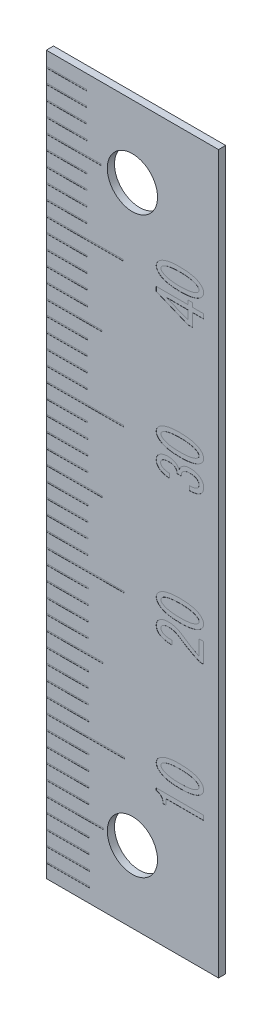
from build123d import *

# Parameters (mm, degrees)
SKETCH1_W      = 12
SKETCH1_H      = 50
EXTRUDE1_DEPTH = 0.5
SKETCH2_R      = 1.75
EXTRUDE2_DEPTH = 52.42227144
EXTRUDE3_DEPTH = 0.01
EXTRUDE4_DEPTH = 0.01


with BuildPart() as part:
    # Sketch1 → Extrude1 (new body)
    with BuildSketch(Plane.XY):
        with Locations((6, 25)):
            Rectangle(SKETCH1_W, SKETCH1_H)
    extrude(amount=EXTRUDE1_DEPTH)

    # Sketch2 → Extrude2 (cut, through all)
    with BuildSketch(Plane.XY.offset(0.5)):
        with Locations((6, 5)):
            Circle(SKETCH2_R)
        with Locations((6, 45)):
            Circle(SKETCH2_R)
    extrude(amount=-EXTRUDE2_DEPTH, mode=Mode.SUBTRACT)

    # Sketch3 → Extrude3 (cut)
    # profile 1 of 8: a face of its own
    with BuildSketch(Plane.XY.offset(0.5)):
        Polygon((10.964202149, 39.253595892), (10.576078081, 39.253595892), (10.18481385, 39.253595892), (10.18481385, 38.358021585), (9.863889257, 38.358021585), (7.659495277, 39.263016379), (7.659495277, 39.57326442), (9.863889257, 39.57326442), (9.863889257, 39.857135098), (10.18481385, 39.857135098), (10.18481385, 39.57326442), (10.964202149, 39.57326442), align=None)
        Polygon((9.863889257, 39.253595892), (8.371684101, 39.253595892), (9.863889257, 38.655080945), align=None, mode=Mode.SUBTRACT)
    # profile 2 of 8: a face of its own
    with BuildSketch(Plane.XY.offset(0.5)):
        with BuildLine():
            add(Edge.make_bspline(
                [(9.304312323, 40.08636695), (9.263487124, 40.086598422), (9.183284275, 40.087053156), (9.065184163, 40.090916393), (8.951677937, 40.097059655), (8.842790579, 40.105920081), (8.738418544, 40.116877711), (8.638826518, 40.131643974), (8.543659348, 40.147711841), (8.453367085, 40.166540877), (8.367534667, 40.187646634), (8.286660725, 40.212475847), (8.209981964, 40.238496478), (8.13792646, 40.267351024), (8.071052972, 40.299483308), (8.008231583, 40.333293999), (7.950513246, 40.370357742), (7.914537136, 40.397244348), (7.896891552, 40.410431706)],
                knots=[0, 0, 0, 0, 1.334199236, 2.621091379, 3.861325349, 5.048806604, 6.191184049, 7.29033474, 8.338632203, 9.344988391, 10.304094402, 11.226124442, 12.10888774, 12.949942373, 13.760906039, 14.53244093, 15.280190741, 16, 16, 16, 16], degree=3))
            add(Edge.make_bspline(
                [(7.896891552, 40.410431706), (7.877886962, 40.425936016), (7.841081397, 40.455962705), (7.793642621, 40.506288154), (7.75209867, 40.556343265), (7.718531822, 40.608467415), (7.691781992, 40.661574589), (7.673561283, 40.716630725), (7.661657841, 40.77250316), (7.660214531, 40.810429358), (7.659495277, 40.829329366)],
                knots=[0, 0, 0, 0, 1.179273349, 2.283859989, 3.322502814, 4.306324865, 5.261663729, 6.17616916, 7.091118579, 8, 8, 8, 8], degree=3))
            add(Edge.make_bspline(
                [(7.659495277, 40.829329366), (7.660212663, 40.848230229), (7.661652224, 40.886158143), (7.67358392, 40.942017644), (7.691636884, 40.996945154), (7.718688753, 41.049705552), (7.752296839, 41.101723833), (7.793217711, 41.152330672), (7.841340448, 41.202029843), (7.877935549, 41.232049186), (7.896891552, 41.247598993)],
                knots=[0, 0, 0, 0, 0.909839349, 1.825753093, 2.741222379, 3.688535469, 4.673394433, 5.720979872, 6.819483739, 8, 8, 8, 8], degree=3))
            add(Edge.make_bspline(
                [(7.896891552, 41.247598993), (7.914537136, 41.260786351), (7.950513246, 41.287672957), (8.008231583, 41.3247367), (8.071052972, 41.358547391), (8.13792646, 41.390679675), (8.209981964, 41.419534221), (8.286660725, 41.445554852), (8.367534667, 41.470384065), (8.453367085, 41.491489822), (8.543659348, 41.510318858), (8.638826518, 41.526386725), (8.738418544, 41.541152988), (8.842790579, 41.552110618), (8.951677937, 41.560971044), (9.065184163, 41.567114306), (9.183284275, 41.570977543), (9.263487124, 41.571432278), (9.304312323, 41.571663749)],
                knots=[0, 0, 0, 0, 0.719809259, 1.46755907, 2.239093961, 3.050057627, 3.89111226, 4.773875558, 5.695905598, 6.655011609, 7.661367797, 8.70966526, 9.808815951, 10.951193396, 12.138674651, 13.378908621, 14.665800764, 16, 16, 16, 16], degree=3))
            add(Edge.make_bspline(
                [(9.304312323, 41.571663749), (9.345974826, 41.571432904), (9.427642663, 41.570980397), (9.547627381, 41.567132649), (9.662805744, 41.560946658), (9.773365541, 41.552091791), (9.879218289, 41.541255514), (9.980042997, 41.52631378), (10.076267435, 41.510328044), (10.167806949, 41.49146689), (10.25471717, 41.470480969), (10.336402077, 41.445542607), (10.413707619, 41.419531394), (10.486394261, 41.390685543), (10.553875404, 41.358519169), (10.617234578, 41.324907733), (10.675058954, 41.28765614), (10.711041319, 41.260780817), (10.728689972, 41.247598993)],
                knots=[0, 0, 0, 0, 1.346341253, 2.639130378, 3.8790076, 5.073442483, 6.223226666, 7.316783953, 8.366697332, 9.375051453, 10.336565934, 11.254764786, 12.134057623, 12.971986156, 13.779994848, 14.548849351, 15.288238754, 16, 16, 16, 16], degree=3))
            add(Edge.make_bspline(
                [(10.728689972, 41.247598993), (10.747351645, 41.231964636), (10.783604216, 41.201592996), (10.832476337, 41.152791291), (10.872490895, 41.101447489), (10.906527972, 41.049937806), (10.932289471, 40.996615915), (10.951811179, 40.942259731), (10.962410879, 40.886054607), (10.964024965, 40.848209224), (10.964830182, 40.829329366)],
                knots=[0, 0, 0, 0, 1.1743338, 2.28128622, 3.323893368, 4.309986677, 5.254013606, 6.173907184, 7.08902033, 8, 8, 8, 8], degree=3))
            add(Edge.make_bspline(
                [(10.964830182, 40.829329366), (10.964023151, 40.81045032), (10.962405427, 40.772606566), (10.95183315, 40.716389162), (10.932141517, 40.661902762), (10.906685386, 40.608236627), (10.872691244, 40.556620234), (10.832051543, 40.505827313), (10.783860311, 40.456400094), (10.747399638, 40.426020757), (10.728689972, 40.410431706)],
                knots=[0, 0, 0, 0, 0.910025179, 1.824179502, 2.743109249, 3.69522398, 4.680284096, 5.713901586, 6.826896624, 8, 8, 8, 8], degree=3))
            add(Edge.make_bspline(
                [(10.728689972, 40.410431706), (10.711041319, 40.397249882), (10.675058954, 40.370374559), (10.617234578, 40.333122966), (10.553875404, 40.29951153), (10.486394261, 40.267345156), (10.413707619, 40.238499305), (10.336402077, 40.212488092), (10.25471717, 40.18754973), (10.167806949, 40.166563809), (10.076267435, 40.147702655), (9.980042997, 40.131716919), (9.879218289, 40.116775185), (9.773365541, 40.105938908), (9.662805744, 40.097084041), (9.547627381, 40.09089805), (9.427642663, 40.087050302), (9.345974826, 40.086597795), (9.304312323, 40.08636695)],
                knots=[0, 0, 0, 0, 0.711761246, 1.451150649, 2.220005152, 3.028013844, 3.865942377, 4.745235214, 5.663434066, 6.624948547, 7.633302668, 8.683216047, 9.776773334, 10.926557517, 12.1209924, 13.360869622, 14.653658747, 16, 16, 16, 16], degree=3))
        make_face()
        with BuildLine():
            add(Edge.make_bspline(
                [(9.304312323, 41.261415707), (9.267676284, 41.261069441), (9.195861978, 41.260390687), (9.090316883, 41.258165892), (8.989150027, 41.253278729), (8.892481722, 41.245290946), (8.80022693, 41.237179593), (8.712814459, 41.225295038), (8.629718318, 41.213328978), (8.551258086, 41.197943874), (8.47692929, 41.181420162), (8.407398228, 41.16150603), (8.341873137, 41.141413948), (8.281453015, 41.117852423), (8.225379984, 41.092883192), (8.173815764, 41.065786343), (8.126168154, 41.037204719), (8.097468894, 41.015283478), (8.083417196, 41.004550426)],
                knots=[0, 0, 0, 0, 1.387476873, 2.71974516, 3.997715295, 5.222316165, 6.392993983, 7.5041764, 8.562605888, 9.571696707, 10.531368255, 11.445041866, 12.310057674, 13.125709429, 13.899281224, 14.633331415, 15.330853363, 16, 16, 16, 16], degree=3))
            add(Edge.make_bspline(
                [(8.083417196, 41.004550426), (8.067942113, 40.991309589), (8.038992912, 40.966539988), (8.006840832, 40.922559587), (7.985224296, 40.87705391), (7.982844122, 40.845041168), (7.981675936, 40.829329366)],
                knots=[0, 0, 0, 0, 1.162721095, 2.175099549, 3.10434177, 4, 4, 4, 4], degree=3))
            add(Edge.make_bspline(
                [(7.981675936, 40.829329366), (7.982836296, 40.813611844), (7.985200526, 40.781587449), (8.007018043, 40.736019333), (8.038753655, 40.691521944), (8.067903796, 40.666693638), (8.083417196, 40.653480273)],
                knots=[0, 0, 0, 0, 0.893494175, 1.820491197, 2.840088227, 4, 4, 4, 4], degree=3))
            add(Edge.make_bspline(
                [(8.083417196, 40.653480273), (8.098156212, 40.643035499), (8.128454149, 40.621564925), (8.177291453, 40.592299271), (8.230299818, 40.565060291), (8.287887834, 40.540907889), (8.349363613, 40.517529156), (8.415145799, 40.496237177), (8.485227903, 40.477516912), (8.559390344, 40.460570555), (8.637959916, 40.445608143), (8.720652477, 40.432335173), (8.807623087, 40.421817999), (8.898748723, 40.413272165), (8.994176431, 40.405404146), (9.093874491, 40.400498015), (9.197746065, 40.398267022), (9.268304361, 40.397589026), (9.304312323, 40.397243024)],
                knots=[0, 0, 0, 0, 0.684573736, 1.407229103, 2.156074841, 2.941731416, 3.772993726, 4.648817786, 5.561264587, 6.521855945, 7.531913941, 8.592575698, 9.69595549, 10.851956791, 12.06190895, 13.325252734, 14.634998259, 16, 16, 16, 16], degree=3))
            add(Edge.make_bspline(
                [(9.304312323, 40.397243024), (9.341785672, 40.397588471), (9.415065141, 40.398263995), (9.522703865, 40.400490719), (9.625541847, 40.405385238), (9.723691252, 40.413273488), (9.817323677, 40.421841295), (9.906404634, 40.432229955), (9.990753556, 40.445635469), (10.070391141, 40.460491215), (10.145369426, 40.477539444), (10.215901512, 40.496147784), (10.281702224, 40.517419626), (10.342729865, 40.540898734), (10.399661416, 40.565104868), (10.451853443, 40.591966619), (10.49904188, 40.621590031), (10.528053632, 40.643045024), (10.542164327, 40.653480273)],
                knots=[0, 0, 0, 0, 1.401046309, 2.739758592, 4.0248449, 5.249399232, 6.420696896, 7.540008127, 8.601571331, 9.613140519, 10.568176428, 11.475655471, 12.339456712, 13.151990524, 13.919674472, 14.651282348, 15.344012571, 16, 16, 16, 16], degree=3))
            add(Edge.make_bspline(
                [(10.542164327, 40.653480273), (10.557596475, 40.666746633), (10.586687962, 40.691755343), (10.619429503, 40.735654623), (10.640196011, 40.781762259), (10.642682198, 40.813642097), (10.643905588, 40.829329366)],
                knots=[0, 0, 0, 0, 1.159232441, 2.18529495, 3.107029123, 4, 4, 4, 4], degree=3))
            add(Edge.make_bspline(
                [(10.643905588, 40.829329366), (10.642674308, 40.845010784), (10.640172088, 40.876878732), (10.619603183, 40.922925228), (10.586449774, 40.966304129), (10.557558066, 40.991255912), (10.542164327, 41.004550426)],
                knots=[0, 0, 0, 0, 0.89511734, 1.819067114, 2.837981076, 4, 4, 4, 4], degree=3))
            add(Edge.make_bspline(
                [(10.542164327, 41.004550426), (10.528109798, 41.015278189), (10.499404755, 41.037188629), (10.45164342, 41.065951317), (10.399548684, 41.092855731), (10.342868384, 41.117856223), (10.281814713, 41.14140776), (10.215668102, 41.161504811), (10.14550559, 41.181409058), (10.070358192, 41.198018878), (9.990830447, 41.213306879), (9.906283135, 41.225349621), (9.817389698, 41.237124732), (9.72367965, 41.245296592), (9.625545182, 41.253298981), (9.522702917, 41.258160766), (9.415065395, 41.26039668), (9.341785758, 41.261070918), (9.304312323, 41.261415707)],
                knots=[0, 0, 0, 0, 0.660466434, 1.348940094, 2.080407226, 2.851088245, 3.663465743, 4.524722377, 5.434082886, 6.388935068, 7.400309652, 8.46048529, 9.580538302, 10.751610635, 11.975929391, 13.260768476, 14.599223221, 16, 16, 16, 16], degree=3))
        make_face(mode=Mode.SUBTRACT)
    # profile 3 of 8: a face of its own
    with BuildSketch(Plane.XY.offset(0.5)):
        with BuildLine():
            add(Edge.make_bspline(
                [(9.982587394, 28.709091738), (10.012525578, 28.708287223), (10.070543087, 28.706728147), (10.154420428, 28.710760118), (10.232130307, 28.718455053), (10.303298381, 28.73168567), (10.368273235, 28.749141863), (10.427053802, 28.770782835), (10.479378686, 28.79791141), (10.510164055, 28.820091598), (10.525207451, 28.830930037)],
                knots=[0, 0, 0, 0, 1.267087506, 2.455501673, 3.55133733, 4.569646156, 5.515332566, 6.395721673, 7.21606285, 8, 8, 8, 8], degree=3))
            add(Edge.make_bspline(
                [(10.525207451, 28.830930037), (10.543506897, 28.847280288), (10.579345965, 28.8793019), (10.617183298, 28.941459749), (10.639871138, 29.011713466), (10.642530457, 29.061449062), (10.643905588, 29.087167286)],
                knots=[0, 0, 0, 0, 1.002413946, 1.963205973, 2.946775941, 4, 4, 4, 4], degree=3))
            add(Edge.make_bspline(
                [(10.643905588, 29.087167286), (10.64205895, 29.10966892), (10.638250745, 29.15607263), (10.60631016, 29.222801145), (10.557507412, 29.287350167), (10.514319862, 29.324320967), (10.491293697, 29.344032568)],
                knots=[0, 0, 0, 0, 0.87119639, 1.796613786, 2.82522778, 4, 4, 4, 4], degree=3))
            add(Edge.make_bspline(
                [(10.491293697, 29.344032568), (10.477715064, 29.35383947), (10.449615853, 29.374133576), (10.40102721, 29.398039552), (10.347048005, 29.41973801), (10.286272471, 29.436247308), (10.219328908, 29.449449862), (10.146079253, 29.458528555), (10.066417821, 29.464292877), (10.011278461, 29.464917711), (9.982587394, 29.465242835)],
                knots=[0, 0, 0, 0, 0.754595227, 1.561536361, 2.43511806, 3.377163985, 4.397951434, 5.512234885, 6.705522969, 8, 8, 8, 8], degree=3))
            add(Edge.make_bspline(
                [(9.982587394, 29.465242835), (9.960377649, 29.46473344), (9.916687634, 29.463731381), (9.85267071, 29.456647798), (9.791236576, 29.44559945), (9.732735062, 29.428991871), (9.676430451, 29.40846888), (9.623062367, 29.382368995), (9.571883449, 29.352579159), (9.540443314, 29.328863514), (9.524751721, 29.317027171)],
                knots=[0, 0, 0, 0, 1.086352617, 2.137024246, 3.147391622, 4.136355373, 5.10847195, 6.074961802, 7.039224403, 8, 8, 8, 8], degree=3))
            add(Edge.make_bspline(
                [(9.524751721, 29.317027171), (9.514022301, 29.307663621), (9.492758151, 29.289106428), (9.465670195, 29.256771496), (9.44319759, 29.221167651), (9.426529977, 29.181802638), (9.413593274, 29.139332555), (9.406578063, 29.093273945), (9.403067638, 29.044064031), (9.405038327, 29.010337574), (9.406053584, 28.992962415)],
                knots=[0, 0, 0, 0, 0.947861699, 1.87852391, 2.799832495, 3.743268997, 4.71875736, 5.750864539, 6.841292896, 8, 8, 8, 8], degree=3))
            Line((9.406053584, 28.992962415), (9.117786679, 28.992962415))
            add(Edge.make_bspline(
                [(9.117786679, 28.992962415), (9.115917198, 29.01036469), (9.11227151, 29.044300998), (9.103170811, 29.09366086), (9.089082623, 29.139312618), (9.072365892, 29.182135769), (9.050836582, 29.220887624), (9.026138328, 29.256550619), (8.997813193, 29.288974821), (8.976089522, 29.307646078), (8.965174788, 29.317027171)],
                knots=[0, 0, 0, 0, 1.139052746, 2.221275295, 3.260086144, 4.244297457, 5.207730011, 6.137529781, 7.064229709, 8, 8, 8, 8], degree=3))
            add(Edge.make_bspline(
                [(8.965174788, 29.317027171), (8.953430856, 29.325692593), (8.929384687, 29.343435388), (8.888683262, 29.365118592), (8.844024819, 29.38418922), (8.794826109, 29.398815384), (8.741812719, 29.411043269), (8.684417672, 29.41879032), (8.62278159, 29.423939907), (8.580202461, 29.42467109), (8.558209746, 29.425048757)],
                knots=[0, 0, 0, 0, 0.816014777, 1.670822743, 2.574059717, 3.530392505, 4.539613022, 5.616822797, 6.769055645, 8, 8, 8, 8], degree=3))
            add(Edge.make_bspline(
                [(8.558209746, 29.425048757), (8.530985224, 29.424710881), (8.478357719, 29.424057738), (8.402231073, 29.418395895), (8.331762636, 29.409047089), (8.266898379, 29.396390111), (8.208285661, 29.3784051), (8.154956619, 29.358063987), (8.10766056, 29.33316966), (8.079858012, 29.312952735), (8.06646032, 29.303210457)],
                knots=[0, 0, 0, 0, 1.267211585, 2.44963652, 3.550842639, 4.575246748, 5.5217347, 6.401234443, 7.229575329, 8, 8, 8, 8], degree=3))
            add(Edge.make_bspline(
                [(8.06646032, 29.303210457), (8.050800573, 29.289680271), (8.020516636, 29.263514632), (7.989112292, 29.21338768), (7.967772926, 29.159180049), (7.965751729, 29.120663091), (7.964719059, 29.100984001)],
                knots=[0, 0, 0, 0, 1.053722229, 2.037763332, 2.997453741, 4, 4, 4, 4], degree=3))
            add(Edge.make_bspline(
                [(7.964719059, 29.100984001), (7.965793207, 29.081323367), (7.967906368, 29.0426452), (7.988749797, 28.988170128), (8.020925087, 28.938367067), (8.050860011, 28.911914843), (8.06646032, 28.898129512)],
                knots=[0, 0, 0, 0, 1.000412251, 1.968100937, 2.94109465, 4, 4, 4, 4], degree=3))
            add(Edge.make_bspline(
                [(8.06646032, 28.898129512), (8.081277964, 28.887055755), (8.111428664, 28.864523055), (8.162612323, 28.837488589), (8.218046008, 28.812216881), (8.279698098, 28.793150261), (8.345928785, 28.775455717), (8.417710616, 28.763754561), (8.494531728, 28.75366975), (8.547707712, 28.75119286), (8.575166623, 28.749913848)],
                knots=[0, 0, 0, 0, 0.823448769, 1.675540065, 2.573857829, 3.535986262, 4.547798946, 5.627975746, 6.775138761, 8, 8, 8, 8], degree=3))
            Line((8.575166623, 28.749913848), (8.575166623, 28.452854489))
            add(Edge.make_bspline(
                [(8.575166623, 28.452854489), (8.539320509, 28.454383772), (8.469081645, 28.457380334), (8.36662153, 28.471341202), (8.269148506, 28.489228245), (8.177509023, 28.515831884), (8.090488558, 28.54647123), (8.009243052, 28.585395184), (7.932662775, 28.629471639), (7.886090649, 28.664635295), (7.862977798, 28.682086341)],
                knots=[0, 0, 0, 0, 1.130465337, 2.215096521, 3.257023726, 4.251490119, 5.220175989, 6.161913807, 7.087793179, 8, 8, 8, 8], degree=3))
            add(Edge.make_bspline(
                [(7.862977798, 28.682086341), (7.8467956, 28.695809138), (7.81513049, 28.722661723), (7.772968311, 28.767477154), (7.738724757, 28.816404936), (7.709237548, 28.867139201), (7.68725208, 28.92158891), (7.670766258, 28.978543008), (7.661240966, 29.038909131), (7.660084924, 29.080016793), (7.659495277, 29.100984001)],
                knots=[0, 0, 0, 0, 1.054146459, 2.062739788, 3.04727221, 4.0164563, 4.972878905, 5.957576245, 6.958249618, 8, 8, 8, 8], degree=3))
            add(Edge.make_bspline(
                [(7.659495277, 29.100984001), (7.660084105, 29.122995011), (7.661233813, 29.165972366), (7.67065538, 29.228867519), (7.687412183, 29.288028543), (7.708926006, 29.344536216), (7.738532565, 29.396768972), (7.773183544, 29.446397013), (7.814699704, 29.492477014), (7.846729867, 29.519408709), (7.862977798, 29.533070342)],
                knots=[0, 0, 0, 0, 1.066551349, 2.082482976, 3.072030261, 4.042353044, 5.005167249, 5.973525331, 6.972030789, 8, 8, 8, 8], degree=3))
            add(Edge.make_bspline(
                [(7.862977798, 29.533070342), (7.883180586, 29.548391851), (7.923800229, 29.579197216), (7.99101211, 29.617407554), (8.063031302, 29.649133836), (8.139054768, 29.676462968), (8.220201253, 29.697274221), (8.306188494, 29.711237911), (8.396823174, 29.720285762), (8.458748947, 29.721491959), (8.490382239, 29.722108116)],
                knots=[0, 0, 0, 0, 0.910342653, 1.830331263, 2.769796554, 3.735781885, 4.730142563, 5.775142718, 6.863485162, 8, 8, 8, 8], degree=3))
            add(Edge.make_bspline(
                [(8.490382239, 29.722108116), (8.519286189, 29.72161156), (8.575295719, 29.720649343), (8.656472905, 29.713669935), (8.732474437, 29.70249683), (8.803229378, 29.686672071), (8.868446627, 29.664650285), (8.928974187, 29.640082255), (8.984286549, 29.610093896), (9.016949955, 29.585400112), (9.033002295, 29.57326442)],
                knots=[0, 0, 0, 0, 1.210143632, 2.344993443, 3.40861805, 4.424997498, 5.37575867, 6.287368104, 7.158331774, 8, 8, 8, 8], degree=3))
            add(Edge.make_bspline(
                [(9.033002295, 29.57326442), (9.059175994, 29.551536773), (9.108490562, 29.51059913), (9.171793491, 29.445781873), (9.221317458, 29.38266922), (9.243208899, 29.337936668), (9.253441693, 29.317027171)],
                knots=[0, 0, 0, 0, 1.195517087, 2.252505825, 3.183162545, 4, 4, 4, 4], degree=3))
            add(Edge.make_bspline(
                [(9.253441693, 29.317027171), (9.265088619, 29.34500906), (9.287538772, 29.398945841), (9.331763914, 29.47199791), (9.381380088, 29.535717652), (9.420772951, 29.570253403), (9.439967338, 29.587081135)],
                knots=[0, 0, 0, 0, 1.094399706, 2.109521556, 3.078854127, 4, 4, 4, 4], degree=3))
            add(Edge.make_bspline(
                [(9.439967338, 29.587081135), (9.459994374, 29.60234586), (9.499821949, 29.632702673), (9.564355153, 29.670989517), (9.632227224, 29.703077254), (9.702874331, 29.730156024), (9.776856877, 29.751027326), (9.854027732, 29.765256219), (9.934226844, 29.774233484), (9.988843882, 29.775485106), (10.016501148, 29.776118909)],
                knots=[0, 0, 0, 0, 0.976244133, 1.941447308, 2.904084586, 3.885987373, 4.873249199, 5.881498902, 6.927222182, 8, 8, 8, 8], degree=3))
            add(Edge.make_bspline(
                [(10.016501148, 29.776118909), (10.052324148, 29.77559206), (10.122443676, 29.774560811), (10.225084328, 29.764261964), (10.322576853, 29.747624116), (10.414506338, 29.72361205), (10.501245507, 29.69357359), (10.582537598, 29.656250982), (10.659144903, 29.612707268), (10.705595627, 29.577553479), (10.728689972, 29.560075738)],
                knots=[0, 0, 0, 0, 1.13285732, 2.217441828, 3.259318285, 4.258350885, 5.219645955, 6.158999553, 7.084692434, 8, 8, 8, 8], degree=3))
            add(Edge.make_bspline(
                [(10.728689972, 29.560075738), (10.747408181, 29.544073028), (10.784031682, 29.512762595), (10.832853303, 29.461250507), (10.873280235, 29.40591535), (10.906871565, 29.348128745), (10.932721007, 29.287091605), (10.951971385, 29.223397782), (10.962541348, 29.156184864), (10.964058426, 29.110438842), (10.964830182, 29.087167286)],
                knots=[0, 0, 0, 0, 1.078182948, 2.109541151, 3.099814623, 4.073306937, 5.030426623, 5.996463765, 6.980776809, 8, 8, 8, 8], degree=3))
            add(Edge.make_bspline(
                [(10.964830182, 29.087167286), (10.964367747, 29.062001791), (10.963461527, 29.012685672), (10.952274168, 28.941195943), (10.935512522, 28.873719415), (10.911441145, 28.810497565), (10.88066456, 28.751121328), (10.842591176, 28.696168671), (10.797876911, 28.645289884), (10.763207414, 28.615937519), (10.745646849, 28.601070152)],
                knots=[0, 0, 0, 0, 1.091653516, 2.139282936, 3.133504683, 4.105839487, 5.069340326, 6.029921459, 7.002128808, 8, 8, 8, 8], degree=3))
            add(Edge.make_bspline(
                [(10.745646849, 28.601070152), (10.723356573, 28.584883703), (10.677849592, 28.551838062), (10.601818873, 28.510403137), (10.51783525, 28.476087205), (10.426096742, 28.448030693), (10.326687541, 28.425207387), (10.21890008, 28.410072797), (10.103344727, 28.400491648), (10.023639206, 28.399403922), (9.982587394, 28.398843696)],
                knots=[0, 0, 0, 0, 0.821972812, 1.678108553, 2.577822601, 3.526913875, 4.539938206, 5.620279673, 6.774340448, 8, 8, 8, 8], degree=3))
            Line((9.982587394, 28.398843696), (9.982587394, 28.709091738))
        make_face()
    # profile 4 of 8: a face of its own
    with BuildSketch(Plane.XY.offset(0.5)):
        with BuildLine():
            add(Edge.make_bspline(
                [(9.304312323, 30.08636695), (9.263487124, 30.086598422), (9.183284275, 30.087053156), (9.065184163, 30.090916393), (8.951677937, 30.097059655), (8.842790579, 30.105920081), (8.738418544, 30.116877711), (8.638826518, 30.131643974), (8.543659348, 30.147711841), (8.453367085, 30.166540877), (8.367534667, 30.187646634), (8.286660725, 30.212475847), (8.209981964, 30.238496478), (8.13792646, 30.267351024), (8.071052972, 30.299483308), (8.008231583, 30.333293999), (7.950513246, 30.370357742), (7.914537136, 30.397244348), (7.896891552, 30.410431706)],
                knots=[0, 0, 0, 0, 1.334199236, 2.621091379, 3.861325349, 5.048806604, 6.191184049, 7.29033474, 8.338632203, 9.344988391, 10.304094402, 11.226124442, 12.10888774, 12.949942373, 13.760906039, 14.53244093, 15.280190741, 16, 16, 16, 16], degree=3))
            add(Edge.make_bspline(
                [(7.896891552, 30.410431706), (7.877886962, 30.425936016), (7.841081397, 30.455962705), (7.793642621, 30.506288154), (7.75209867, 30.556343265), (7.718531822, 30.608467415), (7.691781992, 30.661574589), (7.673561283, 30.716630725), (7.661657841, 30.77250316), (7.660214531, 30.810429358), (7.659495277, 30.829329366)],
                knots=[0, 0, 0, 0, 1.179273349, 2.283859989, 3.322502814, 4.306324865, 5.261663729, 6.17616916, 7.091118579, 8, 8, 8, 8], degree=3))
            add(Edge.make_bspline(
                [(7.659495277, 30.829329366), (7.660212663, 30.848230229), (7.661652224, 30.886158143), (7.67358392, 30.942017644), (7.691636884, 30.996945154), (7.718688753, 31.049705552), (7.752296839, 31.101723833), (7.793217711, 31.152330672), (7.841340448, 31.202029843), (7.877935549, 31.232049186), (7.896891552, 31.247598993)],
                knots=[0, 0, 0, 0, 0.909839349, 1.825753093, 2.741222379, 3.688535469, 4.673394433, 5.720979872, 6.819483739, 8, 8, 8, 8], degree=3))
            add(Edge.make_bspline(
                [(7.896891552, 31.247598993), (7.914537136, 31.260786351), (7.950513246, 31.287672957), (8.008231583, 31.3247367), (8.071052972, 31.358547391), (8.13792646, 31.390679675), (8.209981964, 31.419534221), (8.286660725, 31.445554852), (8.367534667, 31.470384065), (8.453367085, 31.491489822), (8.543659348, 31.510318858), (8.638826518, 31.526386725), (8.738418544, 31.541152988), (8.842790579, 31.552110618), (8.951677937, 31.560971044), (9.065184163, 31.567114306), (9.183284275, 31.570977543), (9.263487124, 31.571432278), (9.304312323, 31.571663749)],
                knots=[0, 0, 0, 0, 0.719809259, 1.46755907, 2.239093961, 3.050057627, 3.89111226, 4.773875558, 5.695905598, 6.655011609, 7.661367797, 8.70966526, 9.808815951, 10.951193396, 12.138674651, 13.378908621, 14.665800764, 16, 16, 16, 16], degree=3))
            add(Edge.make_bspline(
                [(9.304312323, 31.571663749), (9.345974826, 31.571432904), (9.427642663, 31.570980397), (9.547627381, 31.567132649), (9.662805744, 31.560946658), (9.773365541, 31.552091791), (9.879218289, 31.541255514), (9.980042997, 31.52631378), (10.076267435, 31.510328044), (10.167806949, 31.49146689), (10.25471717, 31.470480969), (10.336402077, 31.445542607), (10.413707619, 31.419531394), (10.486394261, 31.390685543), (10.553875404, 31.358519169), (10.617234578, 31.324907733), (10.675058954, 31.28765614), (10.711041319, 31.260780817), (10.728689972, 31.247598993)],
                knots=[0, 0, 0, 0, 1.346341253, 2.639130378, 3.8790076, 5.073442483, 6.223226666, 7.316783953, 8.366697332, 9.375051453, 10.336565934, 11.254764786, 12.134057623, 12.971986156, 13.779994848, 14.548849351, 15.288238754, 16, 16, 16, 16], degree=3))
            add(Edge.make_bspline(
                [(10.728689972, 31.247598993), (10.747351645, 31.231964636), (10.783604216, 31.201592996), (10.832476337, 31.152791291), (10.872490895, 31.101447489), (10.906527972, 31.049937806), (10.932289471, 30.996615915), (10.951811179, 30.942259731), (10.962410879, 30.886054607), (10.964024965, 30.848209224), (10.964830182, 30.829329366)],
                knots=[0, 0, 0, 0, 1.1743338, 2.28128622, 3.323893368, 4.309986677, 5.254013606, 6.173907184, 7.08902033, 8, 8, 8, 8], degree=3))
            add(Edge.make_bspline(
                [(10.964830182, 30.829329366), (10.964023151, 30.81045032), (10.962405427, 30.772606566), (10.95183315, 30.716389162), (10.932141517, 30.661902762), (10.906685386, 30.608236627), (10.872691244, 30.556620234), (10.832051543, 30.505827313), (10.783860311, 30.456400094), (10.747399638, 30.426020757), (10.728689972, 30.410431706)],
                knots=[0, 0, 0, 0, 0.910025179, 1.824179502, 2.743109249, 3.69522398, 4.680284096, 5.713901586, 6.826896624, 8, 8, 8, 8], degree=3))
            add(Edge.make_bspline(
                [(10.728689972, 30.410431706), (10.711041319, 30.397249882), (10.675058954, 30.370374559), (10.617234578, 30.333122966), (10.553875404, 30.29951153), (10.486394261, 30.267345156), (10.413707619, 30.238499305), (10.336402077, 30.212488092), (10.25471717, 30.18754973), (10.167806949, 30.166563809), (10.076267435, 30.147702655), (9.980042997, 30.131716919), (9.879218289, 30.116775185), (9.773365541, 30.105938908), (9.662805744, 30.097084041), (9.547627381, 30.09089805), (9.427642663, 30.087050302), (9.345974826, 30.086597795), (9.304312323, 30.08636695)],
                knots=[0, 0, 0, 0, 0.711761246, 1.451150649, 2.220005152, 3.028013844, 3.865942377, 4.745235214, 5.663434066, 6.624948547, 7.633302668, 8.683216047, 9.776773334, 10.926557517, 12.1209924, 13.360869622, 14.653658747, 16, 16, 16, 16], degree=3))
        make_face()
        with BuildLine():
            add(Edge.make_bspline(
                [(9.304312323, 31.261415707), (9.267676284, 31.261069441), (9.195861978, 31.260390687), (9.090316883, 31.258165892), (8.989150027, 31.253278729), (8.892481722, 31.245290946), (8.80022693, 31.237179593), (8.712814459, 31.225295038), (8.629718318, 31.213328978), (8.551258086, 31.197943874), (8.47692929, 31.181420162), (8.407398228, 31.16150603), (8.341873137, 31.141413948), (8.281453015, 31.117852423), (8.225379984, 31.092883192), (8.173815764, 31.065786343), (8.126168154, 31.037204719), (8.097468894, 31.015283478), (8.083417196, 31.004550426)],
                knots=[0, 0, 0, 0, 1.387476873, 2.71974516, 3.997715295, 5.222316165, 6.392993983, 7.5041764, 8.562605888, 9.571696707, 10.531368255, 11.445041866, 12.310057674, 13.125709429, 13.899281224, 14.633331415, 15.330853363, 16, 16, 16, 16], degree=3))
            add(Edge.make_bspline(
                [(8.083417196, 31.004550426), (8.067942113, 30.991309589), (8.038992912, 30.966539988), (8.006840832, 30.922559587), (7.985224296, 30.87705391), (7.982844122, 30.845041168), (7.981675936, 30.829329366)],
                knots=[0, 0, 0, 0, 1.162721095, 2.175099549, 3.10434177, 4, 4, 4, 4], degree=3))
            add(Edge.make_bspline(
                [(7.981675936, 30.829329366), (7.982836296, 30.813611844), (7.985200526, 30.781587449), (8.007018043, 30.736019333), (8.038753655, 30.691521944), (8.067903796, 30.666693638), (8.083417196, 30.653480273)],
                knots=[0, 0, 0, 0, 0.893494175, 1.820491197, 2.840088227, 4, 4, 4, 4], degree=3))
            add(Edge.make_bspline(
                [(8.083417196, 30.653480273), (8.098156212, 30.643035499), (8.128454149, 30.621564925), (8.177291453, 30.592299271), (8.230299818, 30.565060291), (8.287887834, 30.540907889), (8.349363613, 30.517529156), (8.415145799, 30.496237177), (8.485227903, 30.477516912), (8.559390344, 30.460570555), (8.637959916, 30.445608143), (8.720652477, 30.432335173), (8.807623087, 30.421817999), (8.898748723, 30.413272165), (8.994176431, 30.405404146), (9.093874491, 30.400498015), (9.197746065, 30.398267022), (9.268304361, 30.397589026), (9.304312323, 30.397243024)],
                knots=[0, 0, 0, 0, 0.684573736, 1.407229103, 2.156074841, 2.941731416, 3.772993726, 4.648817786, 5.561264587, 6.521855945, 7.531913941, 8.592575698, 9.69595549, 10.851956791, 12.06190895, 13.325252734, 14.634998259, 16, 16, 16, 16], degree=3))
            add(Edge.make_bspline(
                [(9.304312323, 30.397243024), (9.341785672, 30.397588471), (9.415065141, 30.398263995), (9.522703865, 30.400490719), (9.625541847, 30.405385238), (9.723691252, 30.413273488), (9.817323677, 30.421841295), (9.906404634, 30.432229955), (9.990753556, 30.445635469), (10.070391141, 30.460491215), (10.145369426, 30.477539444), (10.215901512, 30.496147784), (10.281702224, 30.517419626), (10.342729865, 30.540898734), (10.399661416, 30.565104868), (10.451853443, 30.591966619), (10.49904188, 30.621590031), (10.528053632, 30.643045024), (10.542164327, 30.653480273)],
                knots=[0, 0, 0, 0, 1.401046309, 2.739758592, 4.0248449, 5.249399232, 6.420696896, 7.540008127, 8.601571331, 9.613140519, 10.568176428, 11.475655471, 12.339456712, 13.151990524, 13.919674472, 14.651282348, 15.344012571, 16, 16, 16, 16], degree=3))
            add(Edge.make_bspline(
                [(10.542164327, 30.653480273), (10.557596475, 30.666746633), (10.586687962, 30.691755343), (10.619429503, 30.735654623), (10.640196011, 30.781762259), (10.642682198, 30.813642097), (10.643905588, 30.829329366)],
                knots=[0, 0, 0, 0, 1.159232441, 2.18529495, 3.107029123, 4, 4, 4, 4], degree=3))
            add(Edge.make_bspline(
                [(10.643905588, 30.829329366), (10.642674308, 30.845010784), (10.640172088, 30.876878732), (10.619603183, 30.922925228), (10.586449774, 30.966304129), (10.557558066, 30.991255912), (10.542164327, 31.004550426)],
                knots=[0, 0, 0, 0, 0.89511734, 1.819067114, 2.837981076, 4, 4, 4, 4], degree=3))
            add(Edge.make_bspline(
                [(10.542164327, 31.004550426), (10.528109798, 31.015278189), (10.499404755, 31.037188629), (10.45164342, 31.065951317), (10.399548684, 31.092855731), (10.342868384, 31.117856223), (10.281814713, 31.14140776), (10.215668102, 31.161504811), (10.14550559, 31.181409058), (10.070358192, 31.198018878), (9.990830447, 31.213306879), (9.906283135, 31.225349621), (9.817389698, 31.237124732), (9.72367965, 31.245296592), (9.625545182, 31.253298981), (9.522702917, 31.258160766), (9.415065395, 31.26039668), (9.341785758, 31.261070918), (9.304312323, 31.261415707)],
                knots=[0, 0, 0, 0, 0.660466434, 1.348940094, 2.080407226, 2.851088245, 3.663465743, 4.524722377, 5.434082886, 6.388935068, 7.400309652, 8.46048529, 9.580538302, 10.751610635, 11.975929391, 13.260768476, 14.599223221, 16, 16, 16, 16], degree=3))
        make_face(mode=Mode.SUBTRACT)
    # profile 5 of 8: a face of its own
    with BuildSketch(Plane.XY.offset(0.5)):
        with BuildLine():
            Line((10.643905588, 19.789307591), (10.964830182, 19.789307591))
            Line((10.964830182, 19.789307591), (10.964830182, 18.412032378))
            Line((10.964830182, 18.412032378), (10.694776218, 18.412032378))
            add(Edge.make_bspline(
                [(10.694776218, 18.412032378), (10.634104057, 18.438239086), (10.512820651, 18.490626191), (10.333941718, 18.576059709), (10.15666089, 18.664824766), (9.982086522, 18.759401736), (9.809323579, 18.858008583), (9.638392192, 18.960822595), (9.469988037, 19.068963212), (9.359615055, 19.144268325), (9.304312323, 19.18200019)],
                knots=[0, 0, 0, 0, 0.99614483, 1.991289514, 2.987624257, 3.984438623, 4.983697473, 5.985971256, 6.990864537, 8, 8, 8, 8], degree=3))
            add(Edge.make_bspline(
                [(9.304312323, 19.18200019), (9.273407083, 19.202561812), (9.212458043, 19.24311193), (9.117211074, 19.295150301), (9.021104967, 19.339278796), (8.923672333, 19.375332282), (8.825440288, 19.4035815), (8.72593849, 19.42388529), (8.625513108, 19.436178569), (8.558034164, 19.437551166), (8.524295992, 19.438237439)],
                knots=[0, 0, 0, 0, 1.067918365, 2.106070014, 3.119789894, 4.109153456, 5.093164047, 6.058534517, 7.029304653, 8, 8, 8, 8], degree=3))
            add(Edge.make_bspline(
                [(8.524295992, 19.438237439), (8.501046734, 19.437894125), (8.455732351, 19.437224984), (8.389860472, 19.431518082), (8.328132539, 19.422267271), (8.270797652, 19.409104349), (8.21743613, 19.392320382), (8.168710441, 19.370724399), (8.123431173, 19.346637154), (8.096599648, 19.326782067), (8.083417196, 19.317027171)],
                knots=[0, 0, 0, 0, 1.197973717, 2.334932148, 3.404529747, 4.412096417, 5.3640046, 6.281988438, 7.155932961, 8, 8, 8, 8], degree=3))
            add(Edge.make_bspline(
                [(8.083417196, 19.317027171), (8.067746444, 19.303076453), (8.037248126, 19.275925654), (8.005254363, 19.223199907), (7.984772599, 19.164442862), (7.982726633, 19.122515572), (7.981675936, 19.100984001)],
                knots=[0, 0, 0, 0, 1.01321699, 1.971916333, 2.958486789, 4, 4, 4, 4], degree=3))
            add(Edge.make_bspline(
                [(7.981675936, 19.100984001), (7.983585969, 19.082717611), (7.987575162, 19.044567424), (8.01537348, 18.988943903), (8.059276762, 18.934674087), (8.097036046, 18.902326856), (8.11733095, 18.88494083)],
                knots=[0, 0, 0, 0, 0.831770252, 1.737190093, 2.783782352, 4, 4, 4, 4], degree=3))
            add(Edge.make_bspline(
                [(8.11733095, 18.88494083), (8.13152823, 18.875101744), (8.161915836, 18.854042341), (8.215884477, 18.829594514), (8.27953563, 18.808918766), (8.353234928, 18.792609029), (8.436819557, 18.778578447), (8.530630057, 18.769762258), (8.63433812, 18.764032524), (8.706835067, 18.763421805), (8.74473539, 18.76310253)],
                knots=[0, 0, 0, 0, 0.638255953, 1.36611168, 2.182006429, 3.11234378, 4.156826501, 5.317109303, 6.597424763, 8, 8, 8, 8], degree=3))
            Line((8.74473539, 18.76310253), (8.74473539, 18.466043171))
            add(Edge.make_bspline(
                [(8.74473539, 18.466043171), (8.695515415, 18.46790543), (8.600702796, 18.471492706), (8.463728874, 18.483794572), (8.337426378, 18.503038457), (8.221668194, 18.528812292), (8.116016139, 18.559516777), (8.021404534, 18.598268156), (7.936291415, 18.64179784), (7.886844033, 18.67828985), (7.862977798, 18.695903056)],
                knots=[0, 0, 0, 0, 1.276449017, 2.458828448, 3.562299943, 4.585123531, 5.530965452, 6.409552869, 7.23235602, 8, 8, 8, 8], degree=3))
            add(Edge.make_bspline(
                [(7.862977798, 18.695903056), (7.846729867, 18.709564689), (7.814699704, 18.736496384), (7.773183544, 18.782576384), (7.738532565, 18.832204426), (7.708926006, 18.884437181), (7.687412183, 18.940944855), (7.67065538, 19.000105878), (7.661233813, 19.063001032), (7.660084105, 19.105978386), (7.659495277, 19.127989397)],
                knots=[0, 0, 0, 0, 1.027969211, 2.026474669, 2.994832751, 3.957646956, 4.927969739, 5.917517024, 6.933448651, 8, 8, 8, 8], degree=3))
            add(Edge.make_bspline(
                [(7.659495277, 19.127989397), (7.659956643, 19.148979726), (7.660867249, 19.190408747), (7.672379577, 19.250967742), (7.688861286, 19.309450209), (7.71397118, 19.364787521), (7.74481477, 19.418042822), (7.782906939, 19.468678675), (7.828294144, 19.516390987), (7.862484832, 19.545314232), (7.879934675, 19.560075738)],
                knots=[0, 0, 0, 0, 1.000230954, 1.974175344, 2.932001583, 3.893571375, 4.865053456, 5.864036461, 6.909871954, 8, 8, 8, 8], degree=3))
            add(Edge.make_bspline(
                [(7.879934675, 19.560075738), (7.900321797, 19.575446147), (7.941611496, 19.606575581), (8.010569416, 19.644342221), (8.084899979, 19.676515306), (8.164800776, 19.703727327), (8.25083857, 19.724143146), (8.34261768, 19.738396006), (8.43996472, 19.747294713), (8.506900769, 19.748496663), (8.541252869, 19.749113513)],
                knots=[0, 0, 0, 0, 0.873404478, 1.768891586, 2.683909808, 3.645167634, 4.655436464, 5.707963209, 6.823708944, 8, 8, 8, 8], degree=3))
            add(Edge.make_bspline(
                [(8.541252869, 19.749113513), (8.5825466, 19.747997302), (8.665684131, 19.745750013), (8.7908176, 19.728176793), (8.916613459, 19.69873904), (9.043909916, 19.659401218), (9.171696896, 19.607206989), (9.300597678, 19.544064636), (9.430892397, 19.470149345), (9.515481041, 19.41326659), (9.558665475, 19.384226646)],
                knots=[0, 0, 0, 0, 0.902713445, 1.817451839, 2.756860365, 3.725448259, 4.727634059, 5.771721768, 6.862413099, 8, 8, 8, 8], degree=3))
            add(Edge.make_bspline(
                [(9.558665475, 19.384226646), (9.650692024, 19.32107194), (9.831341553, 19.197098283), (10.105692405, 19.027797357), (10.37414261, 18.87223849), (10.555117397, 18.780905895), (10.643905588, 18.736097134)],
                knots=[0, 0, 0, 0, 1.058433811, 2.077721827, 3.056909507, 4, 4, 4, 4], degree=3))
            Line((10.643905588, 18.736097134), (10.643905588, 19.789307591))
        make_face()
    # profile 6 of 8: a face of its own
    with BuildSketch(Plane.XY.offset(0.5)):
        with BuildLine():
            add(Edge.make_bspline(
                [(9.304312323, 20.08636695), (9.263487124, 20.086598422), (9.183284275, 20.087053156), (9.065184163, 20.090916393), (8.951677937, 20.097059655), (8.842790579, 20.105920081), (8.738418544, 20.116877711), (8.638826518, 20.131643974), (8.543659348, 20.147711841), (8.453367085, 20.166540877), (8.367534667, 20.187646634), (8.286660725, 20.212475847), (8.209981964, 20.238496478), (8.13792646, 20.267351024), (8.071052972, 20.299483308), (8.008231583, 20.333293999), (7.950513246, 20.370357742), (7.914537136, 20.397244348), (7.896891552, 20.410431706)],
                knots=[0, 0, 0, 0, 1.334199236, 2.621091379, 3.861325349, 5.048806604, 6.191184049, 7.29033474, 8.338632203, 9.344988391, 10.304094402, 11.226124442, 12.10888774, 12.949942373, 13.760906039, 14.53244093, 15.280190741, 16, 16, 16, 16], degree=3))
            add(Edge.make_bspline(
                [(7.896891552, 20.410431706), (7.877886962, 20.425936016), (7.841081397, 20.455962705), (7.793642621, 20.506288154), (7.75209867, 20.556343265), (7.718531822, 20.608467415), (7.691781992, 20.661574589), (7.673561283, 20.716630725), (7.661657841, 20.77250316), (7.660214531, 20.810429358), (7.659495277, 20.829329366)],
                knots=[0, 0, 0, 0, 1.179273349, 2.283859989, 3.322502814, 4.306324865, 5.261663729, 6.17616916, 7.091118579, 8, 8, 8, 8], degree=3))
            add(Edge.make_bspline(
                [(7.659495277, 20.829329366), (7.660212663, 20.848230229), (7.661652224, 20.886158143), (7.67358392, 20.942017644), (7.691636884, 20.996945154), (7.718688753, 21.049705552), (7.752296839, 21.101723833), (7.793217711, 21.152330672), (7.841340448, 21.202029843), (7.877935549, 21.232049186), (7.896891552, 21.247598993)],
                knots=[0, 0, 0, 0, 0.909839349, 1.825753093, 2.741222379, 3.688535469, 4.673394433, 5.720979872, 6.819483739, 8, 8, 8, 8], degree=3))
            add(Edge.make_bspline(
                [(7.896891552, 21.247598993), (7.914537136, 21.260786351), (7.950513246, 21.287672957), (8.008231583, 21.3247367), (8.071052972, 21.358547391), (8.13792646, 21.390679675), (8.209981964, 21.419534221), (8.286660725, 21.445554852), (8.367534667, 21.470384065), (8.453367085, 21.491489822), (8.543659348, 21.510318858), (8.638826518, 21.526386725), (8.738418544, 21.541152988), (8.842790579, 21.552110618), (8.951677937, 21.560971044), (9.065184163, 21.567114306), (9.183284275, 21.570977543), (9.263487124, 21.571432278), (9.304312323, 21.571663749)],
                knots=[0, 0, 0, 0, 0.719809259, 1.46755907, 2.239093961, 3.050057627, 3.89111226, 4.773875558, 5.695905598, 6.655011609, 7.661367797, 8.70966526, 9.808815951, 10.951193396, 12.138674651, 13.378908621, 14.665800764, 16, 16, 16, 16], degree=3))
            add(Edge.make_bspline(
                [(9.304312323, 21.571663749), (9.345974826, 21.571432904), (9.427642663, 21.570980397), (9.547627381, 21.567132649), (9.662805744, 21.560946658), (9.773365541, 21.552091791), (9.879218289, 21.541255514), (9.980042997, 21.52631378), (10.076267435, 21.510328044), (10.167806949, 21.49146689), (10.25471717, 21.470480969), (10.336402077, 21.445542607), (10.413707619, 21.419531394), (10.486394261, 21.390685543), (10.553875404, 21.358519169), (10.617234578, 21.324907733), (10.675058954, 21.28765614), (10.711041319, 21.260780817), (10.728689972, 21.247598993)],
                knots=[0, 0, 0, 0, 1.346341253, 2.639130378, 3.8790076, 5.073442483, 6.223226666, 7.316783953, 8.366697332, 9.375051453, 10.336565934, 11.254764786, 12.134057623, 12.971986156, 13.779994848, 14.548849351, 15.288238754, 16, 16, 16, 16], degree=3))
            add(Edge.make_bspline(
                [(10.728689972, 21.247598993), (10.747351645, 21.231964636), (10.783604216, 21.201592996), (10.832476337, 21.152791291), (10.872490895, 21.101447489), (10.906527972, 21.049937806), (10.932289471, 20.996615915), (10.951811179, 20.942259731), (10.962410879, 20.886054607), (10.964024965, 20.848209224), (10.964830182, 20.829329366)],
                knots=[0, 0, 0, 0, 1.1743338, 2.28128622, 3.323893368, 4.309986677, 5.254013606, 6.173907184, 7.08902033, 8, 8, 8, 8], degree=3))
            add(Edge.make_bspline(
                [(10.964830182, 20.829329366), (10.964023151, 20.81045032), (10.962405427, 20.772606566), (10.95183315, 20.716389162), (10.932141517, 20.661902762), (10.906685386, 20.608236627), (10.872691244, 20.556620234), (10.832051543, 20.505827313), (10.783860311, 20.456400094), (10.747399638, 20.426020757), (10.728689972, 20.410431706)],
                knots=[0, 0, 0, 0, 0.910025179, 1.824179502, 2.743109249, 3.69522398, 4.680284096, 5.713901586, 6.826896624, 8, 8, 8, 8], degree=3))
            add(Edge.make_bspline(
                [(10.728689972, 20.410431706), (10.711041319, 20.397249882), (10.675058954, 20.370374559), (10.617234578, 20.333122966), (10.553875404, 20.29951153), (10.486394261, 20.267345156), (10.413707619, 20.238499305), (10.336402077, 20.212488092), (10.25471717, 20.18754973), (10.167806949, 20.166563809), (10.076267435, 20.147702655), (9.980042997, 20.131716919), (9.879218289, 20.116775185), (9.773365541, 20.105938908), (9.662805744, 20.097084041), (9.547627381, 20.09089805), (9.427642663, 20.087050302), (9.345974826, 20.086597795), (9.304312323, 20.08636695)],
                knots=[0, 0, 0, 0, 0.711761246, 1.451150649, 2.220005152, 3.028013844, 3.865942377, 4.745235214, 5.663434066, 6.624948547, 7.633302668, 8.683216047, 9.776773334, 10.926557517, 12.1209924, 13.360869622, 14.653658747, 16, 16, 16, 16], degree=3))
        make_face()
        with BuildLine():
            add(Edge.make_bspline(
                [(9.304312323, 21.261415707), (9.267676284, 21.261069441), (9.195861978, 21.260390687), (9.090316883, 21.258165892), (8.989150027, 21.253278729), (8.892481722, 21.245290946), (8.80022693, 21.237179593), (8.712814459, 21.225295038), (8.629718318, 21.213328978), (8.551258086, 21.197943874), (8.47692929, 21.181420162), (8.407398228, 21.16150603), (8.341873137, 21.141413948), (8.281453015, 21.117852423), (8.225379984, 21.092883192), (8.173815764, 21.065786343), (8.126168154, 21.037204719), (8.097468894, 21.015283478), (8.083417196, 21.004550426)],
                knots=[0, 0, 0, 0, 1.387476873, 2.71974516, 3.997715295, 5.222316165, 6.392993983, 7.5041764, 8.562605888, 9.571696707, 10.531368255, 11.445041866, 12.310057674, 13.125709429, 13.899281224, 14.633331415, 15.330853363, 16, 16, 16, 16], degree=3))
            add(Edge.make_bspline(
                [(8.083417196, 21.004550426), (8.067942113, 20.991309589), (8.038992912, 20.966539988), (8.006840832, 20.922559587), (7.985224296, 20.87705391), (7.982844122, 20.845041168), (7.981675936, 20.829329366)],
                knots=[0, 0, 0, 0, 1.162721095, 2.175099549, 3.10434177, 4, 4, 4, 4], degree=3))
            add(Edge.make_bspline(
                [(7.981675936, 20.829329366), (7.982836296, 20.813611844), (7.985200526, 20.781587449), (8.007018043, 20.736019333), (8.038753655, 20.691521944), (8.067903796, 20.666693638), (8.083417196, 20.653480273)],
                knots=[0, 0, 0, 0, 0.893494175, 1.820491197, 2.840088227, 4, 4, 4, 4], degree=3))
            add(Edge.make_bspline(
                [(8.083417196, 20.653480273), (8.098156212, 20.643035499), (8.128454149, 20.621564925), (8.177291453, 20.592299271), (8.230299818, 20.565060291), (8.287887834, 20.540907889), (8.349363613, 20.517529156), (8.415145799, 20.496237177), (8.485227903, 20.477516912), (8.559390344, 20.460570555), (8.637959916, 20.445608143), (8.720652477, 20.432335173), (8.807623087, 20.421817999), (8.898748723, 20.413272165), (8.994176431, 20.405404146), (9.093874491, 20.400498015), (9.197746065, 20.398267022), (9.268304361, 20.397589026), (9.304312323, 20.397243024)],
                knots=[0, 0, 0, 0, 0.684573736, 1.407229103, 2.156074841, 2.941731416, 3.772993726, 4.648817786, 5.561264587, 6.521855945, 7.531913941, 8.592575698, 9.69595549, 10.851956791, 12.06190895, 13.325252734, 14.634998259, 16, 16, 16, 16], degree=3))
            add(Edge.make_bspline(
                [(9.304312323, 20.397243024), (9.341785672, 20.397588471), (9.415065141, 20.398263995), (9.522703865, 20.400490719), (9.625541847, 20.405385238), (9.723691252, 20.413273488), (9.817323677, 20.421841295), (9.906404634, 20.432229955), (9.990753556, 20.445635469), (10.070391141, 20.460491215), (10.145369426, 20.477539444), (10.215901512, 20.496147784), (10.281702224, 20.517419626), (10.342729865, 20.540898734), (10.399661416, 20.565104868), (10.451853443, 20.591966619), (10.49904188, 20.621590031), (10.528053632, 20.643045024), (10.542164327, 20.653480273)],
                knots=[0, 0, 0, 0, 1.401046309, 2.739758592, 4.0248449, 5.249399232, 6.420696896, 7.540008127, 8.601571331, 9.613140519, 10.568176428, 11.475655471, 12.339456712, 13.151990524, 13.919674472, 14.651282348, 15.344012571, 16, 16, 16, 16], degree=3))
            add(Edge.make_bspline(
                [(10.542164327, 20.653480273), (10.557596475, 20.666746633), (10.586687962, 20.691755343), (10.619429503, 20.735654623), (10.640196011, 20.781762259), (10.642682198, 20.813642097), (10.643905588, 20.829329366)],
                knots=[0, 0, 0, 0, 1.159232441, 2.18529495, 3.107029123, 4, 4, 4, 4], degree=3))
            add(Edge.make_bspline(
                [(10.643905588, 20.829329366), (10.642674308, 20.845010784), (10.640172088, 20.876878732), (10.619603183, 20.922925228), (10.586449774, 20.966304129), (10.557558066, 20.991255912), (10.542164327, 21.004550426)],
                knots=[0, 0, 0, 0, 0.89511734, 1.819067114, 2.837981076, 4, 4, 4, 4], degree=3))
            add(Edge.make_bspline(
                [(10.542164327, 21.004550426), (10.528109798, 21.015278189), (10.499404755, 21.037188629), (10.45164342, 21.065951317), (10.399548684, 21.092855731), (10.342868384, 21.117856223), (10.281814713, 21.14140776), (10.215668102, 21.161504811), (10.14550559, 21.181409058), (10.070358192, 21.198018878), (9.990830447, 21.213306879), (9.906283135, 21.225349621), (9.817389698, 21.237124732), (9.72367965, 21.245296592), (9.625545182, 21.253298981), (9.522702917, 21.258160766), (9.415065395, 21.26039668), (9.341785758, 21.261070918), (9.304312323, 21.261415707)],
                knots=[0, 0, 0, 0, 0.660466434, 1.348940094, 2.080407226, 2.851088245, 3.663465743, 4.524722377, 5.434082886, 6.388935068, 7.400309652, 8.46048529, 9.580538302, 10.751610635, 11.975929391, 13.260768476, 14.599223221, 16, 16, 16, 16], degree=3))
        make_face(mode=Mode.SUBTRACT)
    # profile 7 of 8: a face of its own
    with BuildSketch(Plane.XY.offset(0.5)):
        with BuildLine():
            Line((10.964202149, 8.983541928), (9.643449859, 8.983541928))
            Line((9.643449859, 8.983541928), (8.334630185, 8.983541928))
            Line((8.334630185, 8.983541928), (8.334630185, 8.58788147))
            Line((8.334630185, 8.58788147), (8.134287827, 8.58788147))
            add(Edge.make_bspline(
                [(8.134287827, 8.58788147), (8.133949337, 8.607154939), (8.133292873, 8.644533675), (8.127537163, 8.699138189), (8.117992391, 8.750485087), (8.105914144, 8.79930573), (8.088535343, 8.844454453), (8.068559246, 8.887235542), (8.044100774, 8.926478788), (8.016032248, 8.962796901), (7.984633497, 8.996211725), (7.949221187, 9.026469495), (7.910057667, 9.053561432), (7.867120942, 9.077453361), (7.820438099, 9.09818504), (7.770182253, 9.115604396), (7.716225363, 9.130205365), (7.67880858, 9.137442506), (7.659495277, 9.141178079)],
                knots=[0, 0, 0, 0, 1.144858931, 2.220325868, 3.257124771, 4.246590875, 5.202985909, 6.126465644, 7.048017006, 7.94360395, 8.849836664, 9.767181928, 10.705616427, 11.674465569, 12.68221077, 13.736395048, 14.831602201, 16, 16, 16, 16], degree=3))
            Line((7.659495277, 9.141178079), (7.659495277, 9.303210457))
            Line((7.659495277, 9.303210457), (10.964202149, 9.303210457))
            Line((10.964202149, 9.303210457), (10.964202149, 8.983541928))
        make_face()
    # profile 8 of 8: a face of its own
    with BuildSketch(Plane.XY.offset(0.5)):
        with BuildLine():
            add(Edge.make_bspline(
                [(9.304312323, 10.08636695), (9.263487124, 10.086598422), (9.183284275, 10.087053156), (9.065184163, 10.090916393), (8.951677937, 10.097059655), (8.842790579, 10.105920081), (8.738418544, 10.116877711), (8.638826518, 10.131643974), (8.543659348, 10.147711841), (8.453367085, 10.166540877), (8.367534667, 10.187646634), (8.286660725, 10.212475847), (8.209981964, 10.238496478), (8.13792646, 10.267351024), (8.071052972, 10.299483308), (8.008231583, 10.333293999), (7.950513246, 10.370357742), (7.914537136, 10.397244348), (7.896891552, 10.410431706)],
                knots=[0, 0, 0, 0, 1.334199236, 2.621091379, 3.861325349, 5.048806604, 6.191184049, 7.29033474, 8.338632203, 9.344988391, 10.304094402, 11.226124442, 12.10888774, 12.949942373, 13.760906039, 14.53244093, 15.280190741, 16, 16, 16, 16], degree=3))
            add(Edge.make_bspline(
                [(7.896891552, 10.410431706), (7.877886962, 10.425936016), (7.841081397, 10.455962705), (7.793642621, 10.506288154), (7.75209867, 10.556343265), (7.718531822, 10.608467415), (7.691781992, 10.661574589), (7.673561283, 10.716630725), (7.661657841, 10.77250316), (7.660214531, 10.810429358), (7.659495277, 10.829329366)],
                knots=[0, 0, 0, 0, 1.179273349, 2.283859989, 3.322502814, 4.306324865, 5.261663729, 6.17616916, 7.091118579, 8, 8, 8, 8], degree=3))
            add(Edge.make_bspline(
                [(7.659495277, 10.829329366), (7.660212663, 10.848230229), (7.661652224, 10.886158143), (7.67358392, 10.942017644), (7.691636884, 10.996945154), (7.718688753, 11.049705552), (7.752296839, 11.101723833), (7.793217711, 11.152330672), (7.841340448, 11.202029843), (7.877935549, 11.232049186), (7.896891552, 11.247598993)],
                knots=[0, 0, 0, 0, 0.909839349, 1.825753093, 2.741222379, 3.688535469, 4.673394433, 5.720979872, 6.819483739, 8, 8, 8, 8], degree=3))
            add(Edge.make_bspline(
                [(7.896891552, 11.247598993), (7.914537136, 11.260786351), (7.950513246, 11.287672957), (8.008231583, 11.3247367), (8.071052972, 11.358547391), (8.13792646, 11.390679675), (8.209981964, 11.419534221), (8.286660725, 11.445554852), (8.367534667, 11.470384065), (8.453367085, 11.491489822), (8.543659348, 11.510318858), (8.638826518, 11.526386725), (8.738418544, 11.541152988), (8.842790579, 11.552110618), (8.951677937, 11.560971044), (9.065184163, 11.567114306), (9.183284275, 11.570977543), (9.263487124, 11.571432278), (9.304312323, 11.571663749)],
                knots=[0, 0, 0, 0, 0.719809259, 1.46755907, 2.239093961, 3.050057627, 3.89111226, 4.773875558, 5.695905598, 6.655011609, 7.661367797, 8.70966526, 9.808815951, 10.951193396, 12.138674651, 13.378908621, 14.665800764, 16, 16, 16, 16], degree=3))
            add(Edge.make_bspline(
                [(9.304312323, 11.571663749), (9.345974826, 11.571432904), (9.427642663, 11.570980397), (9.547627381, 11.567132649), (9.662805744, 11.560946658), (9.773365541, 11.552091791), (9.879218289, 11.541255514), (9.980042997, 11.52631378), (10.076267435, 11.510328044), (10.167806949, 11.49146689), (10.25471717, 11.470480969), (10.336402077, 11.445542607), (10.413707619, 11.419531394), (10.486394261, 11.390685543), (10.553875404, 11.358519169), (10.617234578, 11.324907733), (10.675058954, 11.28765614), (10.711041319, 11.260780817), (10.728689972, 11.247598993)],
                knots=[0, 0, 0, 0, 1.346341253, 2.639130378, 3.8790076, 5.073442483, 6.223226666, 7.316783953, 8.366697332, 9.375051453, 10.336565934, 11.254764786, 12.134057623, 12.971986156, 13.779994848, 14.548849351, 15.288238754, 16, 16, 16, 16], degree=3))
            add(Edge.make_bspline(
                [(10.728689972, 11.247598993), (10.747351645, 11.231964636), (10.783604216, 11.201592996), (10.832476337, 11.152791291), (10.872490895, 11.101447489), (10.906527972, 11.049937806), (10.932289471, 10.996615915), (10.951811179, 10.942259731), (10.962410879, 10.886054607), (10.964024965, 10.848209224), (10.964830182, 10.829329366)],
                knots=[0, 0, 0, 0, 1.1743338, 2.28128622, 3.323893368, 4.309986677, 5.254013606, 6.173907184, 7.08902033, 8, 8, 8, 8], degree=3))
            add(Edge.make_bspline(
                [(10.964830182, 10.829329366), (10.964023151, 10.81045032), (10.962405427, 10.772606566), (10.95183315, 10.716389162), (10.932141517, 10.661902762), (10.906685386, 10.608236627), (10.872691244, 10.556620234), (10.832051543, 10.505827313), (10.783860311, 10.456400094), (10.747399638, 10.426020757), (10.728689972, 10.410431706)],
                knots=[0, 0, 0, 0, 0.910025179, 1.824179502, 2.743109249, 3.69522398, 4.680284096, 5.713901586, 6.826896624, 8, 8, 8, 8], degree=3))
            add(Edge.make_bspline(
                [(10.728689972, 10.410431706), (10.711041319, 10.397249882), (10.675058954, 10.370374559), (10.617234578, 10.333122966), (10.553875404, 10.29951153), (10.486394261, 10.267345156), (10.413707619, 10.238499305), (10.336402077, 10.212488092), (10.25471717, 10.18754973), (10.167806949, 10.166563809), (10.076267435, 10.147702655), (9.980042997, 10.131716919), (9.879218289, 10.116775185), (9.773365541, 10.105938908), (9.662805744, 10.097084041), (9.547627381, 10.09089805), (9.427642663, 10.087050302), (9.345974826, 10.086597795), (9.304312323, 10.08636695)],
                knots=[0, 0, 0, 0, 0.711761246, 1.451150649, 2.220005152, 3.028013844, 3.865942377, 4.745235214, 5.663434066, 6.624948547, 7.633302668, 8.683216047, 9.776773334, 10.926557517, 12.1209924, 13.360869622, 14.653658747, 16, 16, 16, 16], degree=3))
        make_face()
        with BuildLine():
            add(Edge.make_bspline(
                [(9.304312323, 11.261415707), (9.267676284, 11.261069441), (9.195861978, 11.260390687), (9.090316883, 11.258165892), (8.989150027, 11.253278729), (8.892481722, 11.245290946), (8.80022693, 11.237179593), (8.712814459, 11.225295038), (8.629718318, 11.213328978), (8.551258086, 11.197943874), (8.47692929, 11.181420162), (8.407398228, 11.16150603), (8.341873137, 11.141413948), (8.281453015, 11.117852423), (8.225379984, 11.092883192), (8.173815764, 11.065786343), (8.126168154, 11.037204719), (8.097468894, 11.015283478), (8.083417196, 11.004550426)],
                knots=[0, 0, 0, 0, 1.387476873, 2.71974516, 3.997715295, 5.222316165, 6.392993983, 7.5041764, 8.562605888, 9.571696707, 10.531368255, 11.445041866, 12.310057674, 13.125709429, 13.899281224, 14.633331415, 15.330853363, 16, 16, 16, 16], degree=3))
            add(Edge.make_bspline(
                [(8.083417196, 11.004550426), (8.067942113, 10.991309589), (8.038992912, 10.966539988), (8.006840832, 10.922559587), (7.985224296, 10.87705391), (7.982844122, 10.845041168), (7.981675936, 10.829329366)],
                knots=[0, 0, 0, 0, 1.162721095, 2.175099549, 3.10434177, 4, 4, 4, 4], degree=3))
            add(Edge.make_bspline(
                [(7.981675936, 10.829329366), (7.982836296, 10.813611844), (7.985200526, 10.781587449), (8.007018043, 10.736019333), (8.038753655, 10.691521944), (8.067903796, 10.666693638), (8.083417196, 10.653480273)],
                knots=[0, 0, 0, 0, 0.893494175, 1.820491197, 2.840088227, 4, 4, 4, 4], degree=3))
            add(Edge.make_bspline(
                [(8.083417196, 10.653480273), (8.098156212, 10.643035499), (8.128454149, 10.621564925), (8.177291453, 10.592299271), (8.230299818, 10.565060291), (8.287887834, 10.540907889), (8.349363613, 10.517529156), (8.415145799, 10.496237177), (8.485227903, 10.477516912), (8.559390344, 10.460570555), (8.637959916, 10.445608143), (8.720652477, 10.432335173), (8.807623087, 10.421817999), (8.898748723, 10.413272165), (8.994176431, 10.405404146), (9.093874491, 10.400498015), (9.197746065, 10.398267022), (9.268304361, 10.397589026), (9.304312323, 10.397243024)],
                knots=[0, 0, 0, 0, 0.684573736, 1.407229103, 2.156074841, 2.941731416, 3.772993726, 4.648817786, 5.561264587, 6.521855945, 7.531913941, 8.592575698, 9.69595549, 10.851956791, 12.06190895, 13.325252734, 14.634998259, 16, 16, 16, 16], degree=3))
            add(Edge.make_bspline(
                [(9.304312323, 10.397243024), (9.341785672, 10.397588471), (9.415065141, 10.398263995), (9.522703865, 10.400490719), (9.625541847, 10.405385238), (9.723691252, 10.413273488), (9.817323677, 10.421841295), (9.906404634, 10.432229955), (9.990753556, 10.445635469), (10.070391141, 10.460491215), (10.145369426, 10.477539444), (10.215901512, 10.496147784), (10.281702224, 10.517419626), (10.342729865, 10.540898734), (10.399661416, 10.565104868), (10.451853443, 10.591966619), (10.49904188, 10.621590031), (10.528053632, 10.643045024), (10.542164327, 10.653480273)],
                knots=[0, 0, 0, 0, 1.401046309, 2.739758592, 4.0248449, 5.249399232, 6.420696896, 7.540008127, 8.601571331, 9.613140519, 10.568176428, 11.475655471, 12.339456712, 13.151990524, 13.919674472, 14.651282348, 15.344012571, 16, 16, 16, 16], degree=3))
            add(Edge.make_bspline(
                [(10.542164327, 10.653480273), (10.557596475, 10.666746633), (10.586687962, 10.691755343), (10.619429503, 10.735654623), (10.640196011, 10.781762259), (10.642682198, 10.813642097), (10.643905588, 10.829329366)],
                knots=[0, 0, 0, 0, 1.159232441, 2.18529495, 3.107029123, 4, 4, 4, 4], degree=3))
            add(Edge.make_bspline(
                [(10.643905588, 10.829329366), (10.642674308, 10.845010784), (10.640172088, 10.876878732), (10.619603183, 10.922925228), (10.586449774, 10.966304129), (10.557558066, 10.991255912), (10.542164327, 11.004550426)],
                knots=[0, 0, 0, 0, 0.89511734, 1.819067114, 2.837981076, 4, 4, 4, 4], degree=3))
            add(Edge.make_bspline(
                [(10.542164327, 11.004550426), (10.528109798, 11.015278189), (10.499404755, 11.037188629), (10.45164342, 11.065951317), (10.399548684, 11.092855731), (10.342868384, 11.117856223), (10.281814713, 11.14140776), (10.215668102, 11.161504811), (10.14550559, 11.181409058), (10.070358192, 11.198018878), (9.990830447, 11.213306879), (9.906283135, 11.225349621), (9.817389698, 11.237124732), (9.72367965, 11.245296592), (9.625545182, 11.253298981), (9.522702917, 11.258160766), (9.415065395, 11.26039668), (9.341785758, 11.261070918), (9.304312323, 11.261415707)],
                knots=[0, 0, 0, 0, 0.660466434, 1.348940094, 2.080407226, 2.851088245, 3.663465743, 4.524722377, 5.434082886, 6.388935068, 7.400309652, 8.46048529, 9.580538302, 10.751610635, 11.975929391, 13.260768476, 14.599223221, 16, 16, 16, 16], degree=3))
        make_face(mode=Mode.SUBTRACT)
    extrude(amount=-EXTRUDE3_DEPTH, mode=Mode.SUBTRACT)

    # Sketch4 → Extrude4 (cut)
    with BuildSketch(Plane.XY.offset(0.5)):
        Polygon((2.99592023, 1.038270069), (2.996310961, 0.938270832), (-0.003666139, 0.926548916), (-0.004056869, 1.026548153), align=None)
        Polygon((2.992012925, 2.038262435), (2.992403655, 1.938263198), (-0.007573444, 1.926541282), (-0.007964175, 2.026540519), align=None)
        Polygon((2.988105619, 3.038254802), (2.98849635, 2.938255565), (-0.01148075, 2.926533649), (-0.01187148, 3.026532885), align=None)
        Polygon((2.984198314, 4.038247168), (2.984589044, 3.938247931), (-0.015388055, 3.926526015), (-0.015778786, 4.026525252), align=None)
        Polygon((2.976383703, 6.038231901), (2.976774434, 5.938232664), (-0.023202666, 5.926510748), (-0.023593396, 6.026509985), align=None)
        Polygon((2.972476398, 7.038224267), (2.972867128, 6.938225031), (-0.027109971, 6.926503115), (-0.027500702, 7.026502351), align=None)
        Polygon((2.968569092, 8.038216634), (2.968959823, 7.938217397), (-0.031017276, 7.926495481), (-0.031408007, 8.026494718), align=None)
        Polygon((2.964661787, 9.038209), (2.965052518, 8.938209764), (-0.034924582, 8.926487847), (-0.035315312, 9.026487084), align=None)
        Polygon((3.980674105, 4.942147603), (3.980283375, 5.04214684), (-0.019686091, 5.026517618), (-0.01929536, 4.926518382), align=None)
        Polygon((2.956847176, 11.038193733), (2.957237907, 10.938194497), (-0.042739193, 10.92647258), (-0.043129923, 11.026471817), align=None)
        Polygon((2.952939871, 12.0381861), (2.953330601, 11.938186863), (-0.046646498, 11.926464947), (-0.047037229, 12.026464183), align=None)
        Polygon((2.949032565, 13.038178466), (2.949423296, 12.938179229), (-0.050553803, 12.926457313), (-0.050944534, 13.02645655), align=None)
        Polygon((2.94512526, 14.038170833), (2.945515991, 13.938171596), (-0.054461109, 13.92644968), (-0.054851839, 14.026448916), align=None)
        Polygon((2.937310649, 16.038155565), (2.93770138, 15.938156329), (-0.06227572, 15.926434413), (-0.06266645, 16.026433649), align=None)
        Polygon((2.933403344, 17.038147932), (2.933794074, 16.938148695), (-0.066183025, 16.926426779), (-0.066573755, 17.026426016), align=None)
        Polygon((2.929496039, 18.038140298), (2.929886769, 17.938141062), (-0.07009033, 17.926419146), (-0.070481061, 18.026418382), align=None)
        Polygon((2.925588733, 19.038132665), (2.925979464, 18.938133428), (-0.073997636, 18.926411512), (-0.074388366, 19.026410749), align=None)
        Polygon((3.941601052, 14.942071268), (3.941210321, 15.042070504), (-0.058759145, 15.026441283), (-0.058368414, 14.926442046), align=None)
        Polygon((-0.038831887, 9.926480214), (-0.039222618, 10.026479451), (5.460735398, 10.04796963), (5.461126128, 9.947970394), align=None)
        Polygon((2.917774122, 21.038117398), (2.918164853, 20.938118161), (-0.081812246, 20.926396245), (-0.082202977, 21.026395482), align=None)
        Polygon((2.913866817, 22.038109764), (2.914257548, 21.938110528), (-0.085719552, 21.926388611), (-0.086110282, 22.026387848), align=None)
        Polygon((2.909959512, 23.038102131), (2.910350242, 22.938102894), (-0.089626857, 22.926380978), (-0.090017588, 23.026380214), align=None)
        Polygon((2.906052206, 24.038094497), (2.906442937, 23.93809526), (-0.093534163, 23.926373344), (-0.093924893, 24.026372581), align=None)
        Polygon((2.898237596, 26.03807923), (2.898628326, 25.938079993), (-0.101348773, 25.926358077), (-0.101739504, 26.026357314), align=None)
        Polygon((2.89433029, 27.038071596), (2.894721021, 26.93807236), (-0.105256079, 26.926350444), (-0.105646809, 27.02634968), align=None)
        Polygon((2.890422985, 28.038063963), (2.890813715, 27.938064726), (-0.109163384, 27.92634281), (-0.109554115, 28.026342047), align=None)
        Polygon((2.886515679, 29.038056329), (2.88690641, 28.938057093), (-0.113070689, 28.926335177), (-0.11346142, 29.026334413), align=None)
        Polygon((3.902527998, 24.941994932), (3.902137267, 25.041994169), (-0.097832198, 25.026364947), (-0.097441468, 24.926365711), align=None)
        Polygon((-0.077904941, 19.926403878), (-0.078295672, 20.026403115), (5.421662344, 20.047893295), (5.422053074, 19.947894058), align=None)
        Polygon((2.878701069, 31.038041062), (2.879091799, 30.938041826), (-0.1208853, 30.926319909), (-0.121276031, 31.026319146), align=None)
        Polygon((2.874793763, 32.038033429), (2.875184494, 31.938034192), (-0.124792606, 31.926312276), (-0.125183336, 32.026311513), align=None)
        Polygon((2.870886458, 33.038025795), (2.871277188, 32.938026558), (-0.128699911, 32.926304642), (-0.129090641, 33.026303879), align=None)
        Polygon((2.866979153, 34.038018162), (2.867369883, 33.938018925), (-0.132607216, 33.926297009), (-0.132997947, 34.026296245), align=None)
        Polygon((2.859164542, 36.038002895), (2.859555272, 35.938003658), (-0.140421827, 35.926281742), (-0.140812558, 36.026280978), align=None)
        Polygon((2.855257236, 37.037995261), (2.855647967, 36.937996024), (-0.144329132, 36.926274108), (-0.144719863, 37.026273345), align=None)
        Polygon((2.851349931, 38.037987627), (2.851740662, 37.937988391), (-0.148236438, 37.926266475), (-0.148627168, 38.026265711), align=None)
        Polygon((2.847442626, 39.037979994), (2.847833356, 38.937980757), (-0.152143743, 38.926258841), (-0.152534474, 39.026258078), align=None)
        Polygon((3.863454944, 34.941918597), (3.863064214, 35.041917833), (-0.136905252, 35.026288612), (-0.136514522, 34.926289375), align=None)
        Polygon((2.839628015, 41.037964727), (2.840018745, 40.93796549), (-0.159958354, 40.926243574), (-0.160349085, 41.026242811), align=None)
        Polygon((2.835720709, 42.037957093), (2.83611144, 41.937957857), (-0.163865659, 41.92623594), (-0.16425639, 42.026235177), align=None)
        Polygon((2.831813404, 43.03794946), (2.832204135, 42.937950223), (-0.167772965, 42.926228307), (-0.168163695, 43.026227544), align=None)
        Polygon((2.827906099, 44.037941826), (2.828296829, 43.937942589), (-0.17168027, 43.926220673), (-0.172071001, 44.02621991), align=None)
        Polygon((-0.116977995, 29.926327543), (-0.117368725, 30.02632678), (5.38258929, 30.047816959), (5.382980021, 29.947817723), align=None)
        Polygon((2.820091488, 46.037926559), (2.820482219, 45.937927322), (-0.179494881, 45.926205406), (-0.179885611, 46.026204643), align=None)
        Polygon((2.816184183, 47.037918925), (2.816574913, 46.937919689), (-0.183402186, 46.926197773), (-0.183792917, 47.026197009), align=None)
        Polygon((2.812276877, 48.037911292), (2.812667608, 47.937912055), (-0.187309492, 47.926190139), (-0.187700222, 48.026189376), align=None)
        Polygon((2.808369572, 49.037903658), (2.808760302, 48.937904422), (-0.191216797, 48.926182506), (-0.191607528, 49.026181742), align=None)
        Polygon((3.82438189, 44.941842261), (3.82399116, 45.041841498), (-0.175978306, 45.026212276), (-0.175587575, 44.92621304), align=None)
        Polygon((-0.156051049, 39.926251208), (-0.156441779, 40.026250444), (5.343516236, 40.047740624), (5.343906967, 39.947741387), align=None)
    extrude(amount=-EXTRUDE4_DEPTH, mode=Mode.SUBTRACT)


with BuildPart() as part_1:
    # Body-Move_Copy2: moved
    add(part.part.moved(Location((-12, 0, 0))))


solid = part_1.part
